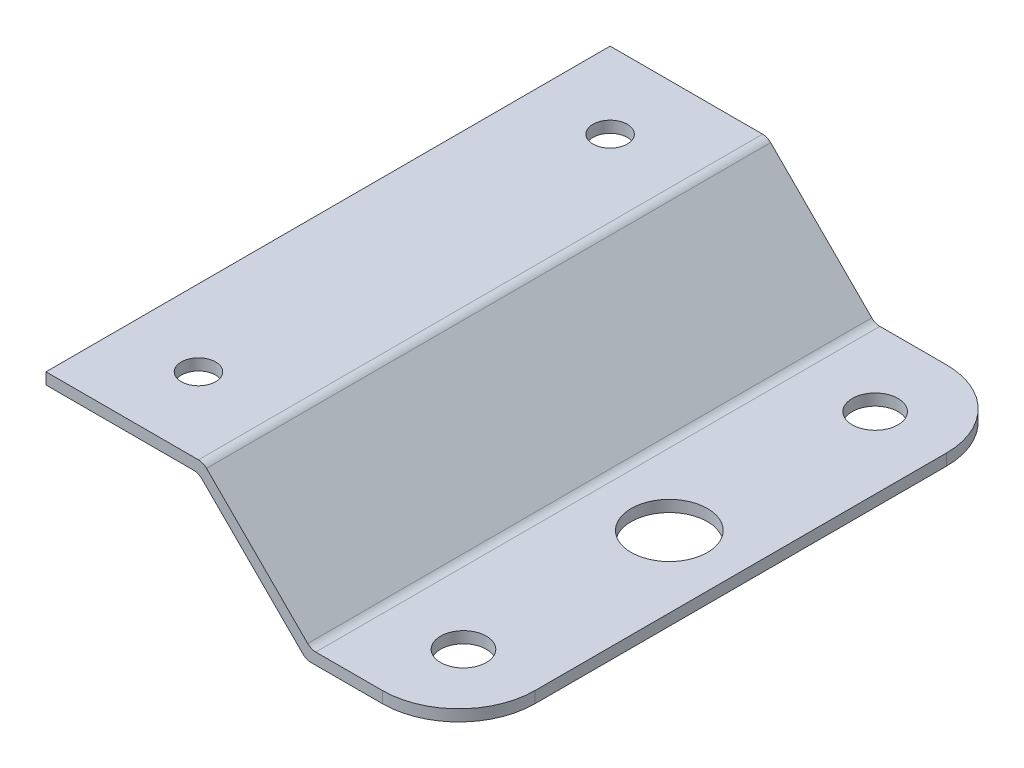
from build123d import *

# Parameters (mm, degrees)
EXTRUDE1_DEPTH     = 74
SKETCH2_R          = 2.25
CUT_EXTRUDE1_DEPTH = 74
SKETCH7_R          = 3
SKETCH7_R_2        = 5
CUT_EXTRUDE2_DEPTH = 74
FILLET2_R          = 10
FILLET3_R          = 10


with BuildPart() as part:
    # Sketch1 → Extrude1 (new body)
    with BuildSketch(Plane.XY):
        with BuildLine():
            Line((20.439339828, -0.439339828), (33.702795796, -13.702795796))
            ThreePointArc((33.702795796, -13.702795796), (34.189430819, -14.027954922), (34.763455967, -14.142135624))
            Line((34.763455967, -14.142135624), (54.142135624, -14.142135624))
            Line((54.142135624, -14.142135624), (54.142135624, -12.642135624))
            Line((54.142135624, -12.642135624), (35.384776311, -12.642135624))
            ThreePointArc((35.384776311, -12.642135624), (34.810751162, -12.527954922), (34.324116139, -12.202795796))
            Line((34.324116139, -12.202795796), (21.060660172, 1.060660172))
            ThreePointArc((21.060660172, 1.060660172), (20.574025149, 1.385819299), (20, 1.5))
            Line((20, 1.5), (0, 1.5))
            Line((0, 1.5), (0, 0))
            Line((0, 0), (19.378679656, 0))
            ThreePointArc((19.378679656, 0), (19.952704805, -0.114180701), (20.439339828, -0.439339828))
        make_face()
    extrude(amount=EXTRUDE1_DEPTH)

    # Sketch2 → Cut-Extrude1 (cut)
    with BuildSketch(Plane(origin=(0, 1.5, 0), x_dir=(-1, 0, 0), z_dir=(0, 1, 0))):
        with Locations((-10, 10)):
            Circle(SKETCH2_R)
        with Locations((-10, 64)):
            Circle(SKETCH2_R)
    extrude(amount=-CUT_EXTRUDE1_DEPTH, mode=Mode.SUBTRACT)

    # Sketch7 → Cut-Extrude2 (cut)
    with BuildSketch(Plane(origin=(0, -12.642135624, 0), x_dir=(-1, 0, 0), z_dir=(0, 1, 0))):
        with Locations((-44.763455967, 64)):
            Circle(SKETCH7_R)
        with Locations((-44.763455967, 10)):
            Circle(SKETCH7_R)
        with Locations((-44.763455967, 37)):
            Circle(SKETCH7_R_2)
    extrude(amount=-CUT_EXTRUDE2_DEPTH, mode=Mode.SUBTRACT)

    # Fillet2
    fillet2_edges = [part.edges().sort_by_distance(p)[0] for p in [
        (54.142135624, -13.392135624, 0),
    ]]
    fillet(fillet2_edges, radius=FILLET2_R)

    # Fillet3
    fillet3_edges = [part.edges().sort_by_distance(p)[0] for p in [
        (54.142135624, -13.392135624, 74),
    ]]
    fillet(fillet3_edges, radius=FILLET3_R)


solid = part.part
